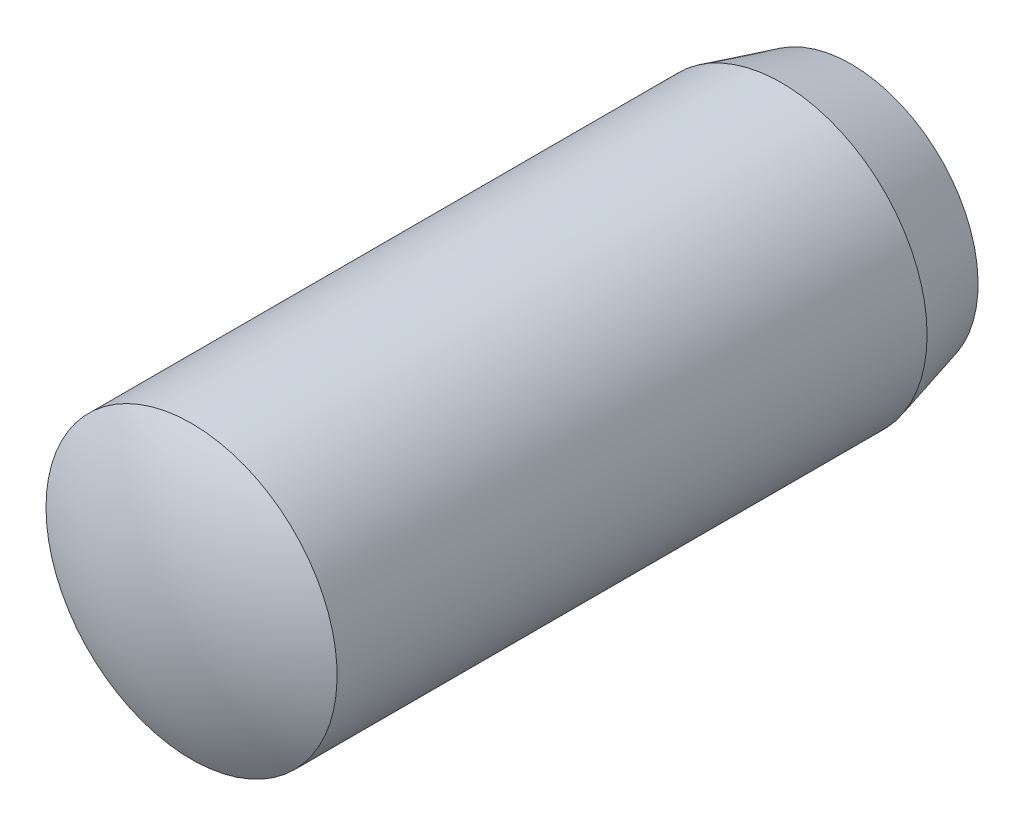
ISO-10303-21;
HEADER;
FILE_DESCRIPTION(('STEP AP214'),'2;1');
FILE_NAME('part.step','',(''),(''),'','','');
FILE_SCHEMA(('AUTOMOTIVE_DESIGN { 1 0 10303 214 1 1 1 1 }'));
ENDSEC;
DATA;
#1=APPLICATION_CONTEXT('core data for automotive mechanical design processes');
#2=APPLICATION_PROTOCOL_DEFINITION('international standard','automotive_design',2000,#1);
#3=PRODUCT_CONTEXT('',#1,'mechanical');
#4=PRODUCT('Part','Part','',(#3));
#5=PRODUCT_RELATED_PRODUCT_CATEGORY('part','',(#4));
#6=PRODUCT_DEFINITION_FORMATION('','',#4);
#7=PRODUCT_DEFINITION_CONTEXT('part definition',#1,'design');
#8=PRODUCT_DEFINITION('design','',#6,#7);
#9=PRODUCT_DEFINITION_SHAPE('','',#8);
#10=(LENGTH_UNIT() NAMED_UNIT(*) SI_UNIT(.MILLI.,.METRE.));
#11=(NAMED_UNIT(*) PLANE_ANGLE_UNIT() SI_UNIT($,.RADIAN.));
#12=(NAMED_UNIT(*) SI_UNIT($,.STERADIAN.) SOLID_ANGLE_UNIT());
#13=UNCERTAINTY_MEASURE_WITH_UNIT(LENGTH_MEASURE(1.E-05),#10,'distance_accuracy_value','');
#14=(GEOMETRIC_REPRESENTATION_CONTEXT(3) GLOBAL_UNCERTAINTY_ASSIGNED_CONTEXT((#13)) GLOBAL_UNIT_ASSIGNED_CONTEXT((#10,
#11,#12)) REPRESENTATION_CONTEXT('',''));
#15=CARTESIAN_POINT('',(0.,0.,0.));
#16=DIRECTION('',(0.,0.,1.));
#17=DIRECTION('',(1.,0.,0.));
#18=AXIS2_PLACEMENT_3D('',#15,#16,#17);
#19=CARTESIAN_POINT('',(0.,0.,-8.00000000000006));
#20=DIRECTION('',(0.,0.,-1.));
#21=DIRECTION('',(0.,1.,0.));
#22=AXIS2_PLACEMENT_3D('',#19,#20,#21);
#23=SPHERICAL_SURFACE('',#22,8.00000000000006);
#24=CARTESIAN_POINT('',(0.,0.,-1.07179676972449));
#25=DIRECTION('',(0.,0.,-1.));
#26=DIRECTION('',(-1.,0.,0.));
#27=AXIS2_PLACEMENT_3D('',#24,#25,#26);
#28=CIRCLE('',#27,4.);
#29=CARTESIAN_POINT('',(-4.,0.,-1.07179676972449));
#30=VERTEX_POINT('',#29);
#31=EDGE_CURVE('E10',#30,#30,#28,.T.);
#32=ORIENTED_EDGE('',*,*,#31,.F.);
#33=EDGE_LOOP('',(#32));
#34=FACE_BOUND('',#33,.T.);
#35=ADVANCED_FACE('F32',(#34),#23,.T.);
#36=CARTESIAN_POINT('',(0.,0.,-20.));
#37=DIRECTION('',(0.,0.,-1.));
#38=DIRECTION('',(-1.,0.,0.));
#39=AXIS2_PLACEMENT_3D('',#36,#37,#38);
#40=CYLINDRICAL_SURFACE('',#39,4.);
#41=ORIENTED_EDGE('',*,*,#31,.T.);
#42=EDGE_LOOP('',(#41));
#43=FACE_BOUND('',#42,.T.);
#44=CARTESIAN_POINT('',(0.,0.,-17.2859026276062));
#45=DIRECTION('',(0.,0.,-1.));
#46=DIRECTION('',(-1.,0.,0.));
#47=AXIS2_PLACEMENT_3D('',#44,#45,#46);
#48=CIRCLE('',#47,4.);
#49=CARTESIAN_POINT('',(-4.,0.,-17.2859026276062));
#50=VERTEX_POINT('',#49);
#51=EDGE_CURVE('E38',#50,#50,#48,.T.);
#52=ORIENTED_EDGE('',*,*,#51,.F.);
#53=EDGE_LOOP('',(#52));
#54=FACE_BOUND('',#53,.T.);
#55=ADVANCED_FACE('F53',(#43,#54),#40,.T.);
#56=CARTESIAN_POINT('',(0.,0.,-19.2));
#57=DIRECTION('',(0.,0.,1.));
#58=DIRECTION('',(1.,0.,0.));
#59=AXIS2_PLACEMENT_3D('',#56,#57,#58);
#60=CONICAL_SURFACE('',#59,3.48711915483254,0.26179938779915);
#61=ORIENTED_EDGE('',*,*,#51,.T.);
#62=EDGE_LOOP('',(#61));
#63=FACE_BOUND('',#62,.T.);
#64=CARTESIAN_POINT('',(0.,0.,-19.2));
#65=DIRECTION('',(0.,0.,-1.));
#66=DIRECTION('',(-1.,0.,0.));
#67=AXIS2_PLACEMENT_3D('',#64,#65,#66);
#68=CIRCLE('',#67,3.48711915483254);
#69=CARTESIAN_POINT('',(-3.48711915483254,0.,-19.2));
#70=VERTEX_POINT('',#69);
#71=EDGE_CURVE('E42',#70,#70,#68,.T.);
#72=ORIENTED_EDGE('',*,*,#71,.F.);
#73=EDGE_LOOP('',(#72));
#74=FACE_BOUND('',#73,.T.);
#75=ADVANCED_FACE('F51',(#63,#74),#60,.T.);
#76=CARTESIAN_POINT('',(0.,0.,-11.9999999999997));
#77=DIRECTION('',(0.,0.,-1.));
#78=DIRECTION('',(0.,1.,0.));
#79=AXIS2_PLACEMENT_3D('',#76,#77,#78);
#80=SPHERICAL_SURFACE('',#79,8.00000000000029);
#81=ORIENTED_EDGE('',*,*,#71,.T.);
#82=EDGE_LOOP('',(#81));
#83=FACE_BOUND('',#82,.T.);
#84=ADVANCED_FACE('F49',(#83),#80,.T.);
#85=CLOSED_SHELL('',(#35,#55,#75,#84));
#86=MANIFOLD_SOLID_BREP('B2',#85);
#87=ADVANCED_BREP_SHAPE_REPRESENTATION('',(#18,#86),#14);
#88=SHAPE_DEFINITION_REPRESENTATION(#9,#87);
ENDSEC;
END-ISO-10303-21;
